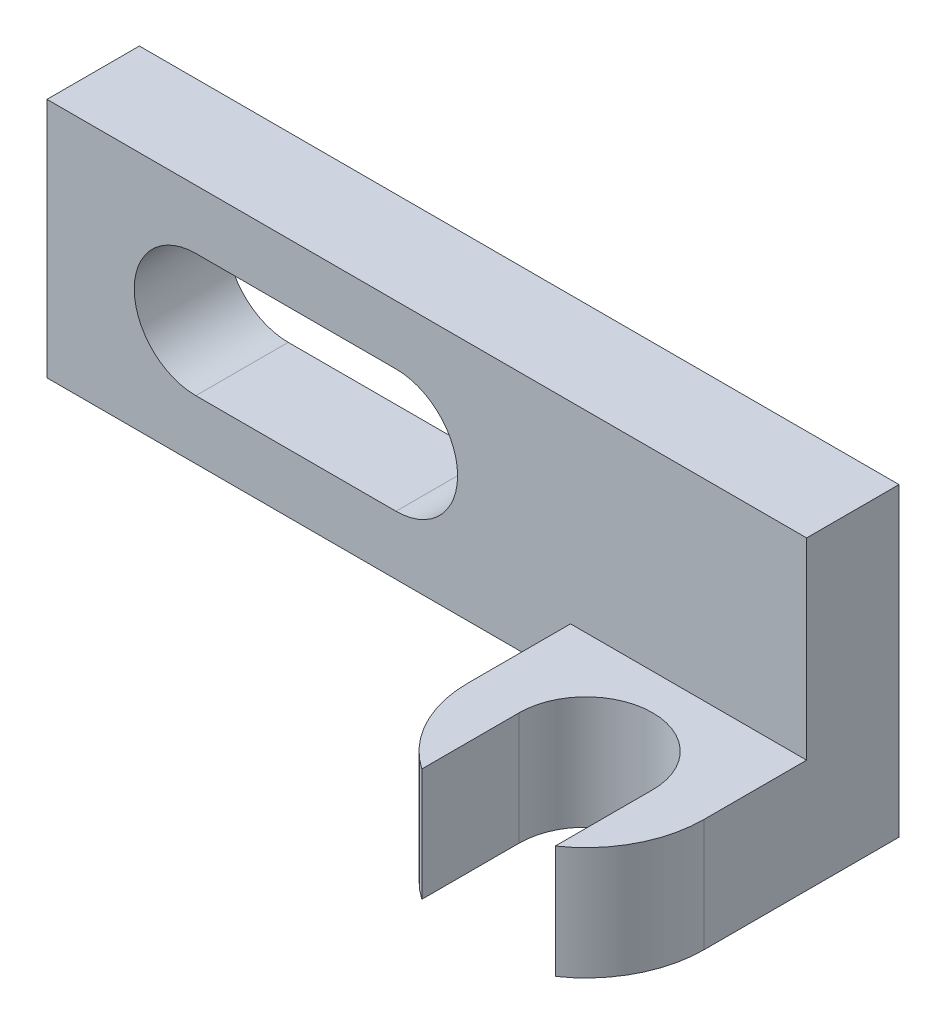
ISO-10303-21;
HEADER;
FILE_DESCRIPTION(('STEP AP214'),'2;1');
FILE_NAME('part.step','',(''),(''),'','','');
FILE_SCHEMA(('AUTOMOTIVE_DESIGN { 1 0 10303 214 1 1 1 1 }'));
ENDSEC;
DATA;
#1=APPLICATION_CONTEXT('core data for automotive mechanical design processes');
#2=APPLICATION_PROTOCOL_DEFINITION('international standard','automotive_design',2000,#1);
#3=PRODUCT_CONTEXT('',#1,'mechanical');
#4=PRODUCT('Part','Part','',(#3));
#5=PRODUCT_RELATED_PRODUCT_CATEGORY('part','',(#4));
#6=PRODUCT_DEFINITION_FORMATION('','',#4);
#7=PRODUCT_DEFINITION_CONTEXT('part definition',#1,'design');
#8=PRODUCT_DEFINITION('design','',#6,#7);
#9=PRODUCT_DEFINITION_SHAPE('','',#8);
#10=(LENGTH_UNIT() NAMED_UNIT(*) SI_UNIT(.MILLI.,.METRE.));
#11=(NAMED_UNIT(*) PLANE_ANGLE_UNIT() SI_UNIT($,.RADIAN.));
#12=(NAMED_UNIT(*) SI_UNIT($,.STERADIAN.) SOLID_ANGLE_UNIT());
#13=UNCERTAINTY_MEASURE_WITH_UNIT(LENGTH_MEASURE(1.E-05),#10,'distance_accuracy_value','');
#14=(GEOMETRIC_REPRESENTATION_CONTEXT(3) GLOBAL_UNCERTAINTY_ASSIGNED_CONTEXT((#13)) GLOBAL_UNIT_ASSIGNED_CONTEXT((#10,
#11,#12)) REPRESENTATION_CONTEXT('',''));
#15=CARTESIAN_POINT('',(0.,0.,0.));
#16=DIRECTION('',(0.,0.,1.));
#17=DIRECTION('',(1.,0.,0.));
#18=AXIS2_PLACEMENT_3D('',#15,#16,#17);
#19=CARTESIAN_POINT('',(-58.,-47.,36.));
#20=DIRECTION('',(0.,0.,1.));
#21=DIRECTION('',(1.,0.,0.));
#22=AXIS2_PLACEMENT_3D('',#19,#20,#21);
#23=PLANE('',#22);
#24=DIRECTION('',(0.,-1.,0.));
#25=VECTOR('',#24,1.);
#26=CARTESIAN_POINT('',(146.,-47.,36.));
#27=LINE('',#26,#25);
#28=CARTESIAN_POINT('',(146.,-28.,36.));
#29=VERTEX_POINT('',#28);
#30=CARTESIAN_POINT('',(146.,-47.,36.));
#31=VERTEX_POINT('',#30);
#32=EDGE_CURVE('E46',#29,#31,#27,.T.);
#33=ORIENTED_EDGE('',*,*,#32,.F.);
#34=DIRECTION('',(-1.,0.,0.));
#35=VECTOR('',#34,1.);
#36=CARTESIAN_POINT('',(-58.,-28.,36.));
#37=LINE('',#36,#35);
#38=CARTESIAN_POINT('',(238.,-28.,36.));
#39=VERTEX_POINT('',#38);
#40=EDGE_CURVE('E206',#39,#29,#37,.T.);
#41=ORIENTED_EDGE('',*,*,#40,.F.);
#42=DIRECTION('',(0.,1.,0.));
#43=VECTOR('',#42,1.);
#44=CARTESIAN_POINT('',(238.,47.,36.));
#45=LINE('',#44,#43);
#46=CARTESIAN_POINT('',(238.,47.,36.));
#47=VERTEX_POINT('',#46);
#48=EDGE_CURVE('E255',#39,#47,#45,.T.);
#49=ORIENTED_EDGE('',*,*,#48,.T.);
#50=DIRECTION('',(-1.,0.,0.));
#51=VECTOR('',#50,1.);
#52=CARTESIAN_POINT('',(-58.,47.,36.));
#53=LINE('',#52,#51);
#54=CARTESIAN_POINT('',(-58.,47.,36.));
#55=VERTEX_POINT('',#54);
#56=EDGE_CURVE('E257',#47,#55,#53,.T.);
#57=ORIENTED_EDGE('',*,*,#56,.T.);
#58=DIRECTION('',(0.,-1.,0.));
#59=VECTOR('',#58,1.);
#60=CARTESIAN_POINT('',(-58.,47.,36.));
#61=LINE('',#60,#59);
#62=CARTESIAN_POINT('',(-58.,-47.,36.));
#63=VERTEX_POINT('',#62);
#64=EDGE_CURVE('E248',#55,#63,#61,.T.);
#65=ORIENTED_EDGE('',*,*,#64,.T.);
#66=DIRECTION('',(1.,0.,0.));
#67=VECTOR('',#66,1.);
#68=CARTESIAN_POINT('',(-58.,-47.,36.));
#69=LINE('',#68,#67);
#70=EDGE_CURVE('E251',#63,#31,#69,.T.);
#71=ORIENTED_EDGE('',*,*,#70,.T.);
#72=EDGE_LOOP('',(#33,#41,#49,#57,#65,#71));
#73=FACE_BOUND('',#72,.T.);
#74=DIRECTION('',(1.,0.,0.));
#75=VECTOR('',#74,1.);
#76=CARTESIAN_POINT('',(78.,-24.,36.));
#77=LINE('',#76,#75);
#78=CARTESIAN_POINT('',(0.,-24.,36.));
#79=VERTEX_POINT('',#78);
#80=CARTESIAN_POINT('',(78.,-24.,36.));
#81=VERTEX_POINT('',#80);
#82=EDGE_CURVE('E221',#79,#81,#77,.T.);
#83=ORIENTED_EDGE('',*,*,#82,.F.);
#84=CARTESIAN_POINT('',(0.,0.,36.));
#85=DIRECTION('',(0.,0.,1.));
#86=DIRECTION('',(-1.,0.,0.));
#87=AXIS2_PLACEMENT_3D('',#84,#85,#86);
#88=CIRCLE('',#87,24.);
#89=CARTESIAN_POINT('',(0.,24.,36.));
#90=VERTEX_POINT('',#89);
#91=EDGE_CURVE('E219',#90,#79,#88,.T.);
#92=ORIENTED_EDGE('',*,*,#91,.F.);
#93=DIRECTION('',(-1.,0.,0.));
#94=VECTOR('',#93,1.);
#95=CARTESIAN_POINT('',(0.,24.,36.));
#96=LINE('',#95,#94);
#97=CARTESIAN_POINT('',(78.,24.,36.));
#98=VERTEX_POINT('',#97);
#99=EDGE_CURVE('E226',#98,#90,#96,.T.);
#100=ORIENTED_EDGE('',*,*,#99,.F.);
#101=CARTESIAN_POINT('',(78.,0.,36.));
#102=DIRECTION('',(0.,0.,1.));
#103=DIRECTION('',(-1.,0.,0.));
#104=AXIS2_PLACEMENT_3D('',#101,#102,#103);
#105=CIRCLE('',#104,24.);
#106=EDGE_CURVE('E224',#81,#98,#105,.T.);
#107=ORIENTED_EDGE('',*,*,#106,.F.);
#108=EDGE_LOOP('',(#83,#92,#100,#107));
#109=FACE_BOUND('',#108,.T.);
#110=ADVANCED_FACE('F31',(#73,#109),#23,.T.);
#111=CARTESIAN_POINT('',(-58.,-47.,0.));
#112=DIRECTION('',(0.,0.,1.));
#113=DIRECTION('',(1.,0.,0.));
#114=AXIS2_PLACEMENT_3D('',#111,#112,#113);
#115=PLANE('',#114);
#116=DIRECTION('',(0.,1.,0.));
#117=VECTOR('',#116,1.);
#118=CARTESIAN_POINT('',(146.,-72.,0.));
#119=LINE('',#118,#117);
#120=CARTESIAN_POINT('',(146.,-72.,0.));
#121=VERTEX_POINT('',#120);
#122=CARTESIAN_POINT('',(146.,-47.,0.));
#123=VERTEX_POINT('',#122);
#124=EDGE_CURVE('E143',#121,#123,#119,.T.);
#125=ORIENTED_EDGE('',*,*,#124,.T.);
#126=DIRECTION('',(1.,0.,0.));
#127=VECTOR('',#126,1.);
#128=CARTESIAN_POINT('',(-58.,-47.,0.));
#129=LINE('',#128,#127);
#130=CARTESIAN_POINT('',(-58.,-47.,0.));
#131=VERTEX_POINT('',#130);
#132=EDGE_CURVE('E262',#131,#123,#129,.T.);
#133=ORIENTED_EDGE('',*,*,#132,.F.);
#134=DIRECTION('',(0.,-1.,0.));
#135=VECTOR('',#134,1.);
#136=CARTESIAN_POINT('',(-58.,47.,0.));
#137=LINE('',#136,#135);
#138=CARTESIAN_POINT('',(-58.,47.,0.));
#139=VERTEX_POINT('',#138);
#140=EDGE_CURVE('E247',#139,#131,#137,.T.);
#141=ORIENTED_EDGE('',*,*,#140,.F.);
#142=DIRECTION('',(-1.,0.,0.));
#143=VECTOR('',#142,1.);
#144=CARTESIAN_POINT('',(-58.,47.,0.));
#145=LINE('',#144,#143);
#146=CARTESIAN_POINT('',(238.,47.,0.));
#147=VERTEX_POINT('',#146);
#148=EDGE_CURVE('E252',#147,#139,#145,.T.);
#149=ORIENTED_EDGE('',*,*,#148,.F.);
#150=DIRECTION('',(0.,1.,0.));
#151=VECTOR('',#150,1.);
#152=CARTESIAN_POINT('',(238.,47.,0.));
#153=LINE('',#152,#151);
#154=CARTESIAN_POINT('',(238.,-72.,0.));
#155=VERTEX_POINT('',#154);
#156=EDGE_CURVE('E168',#155,#147,#153,.T.);
#157=ORIENTED_EDGE('',*,*,#156,.F.);
#158=DIRECTION('',(-1.,0.,0.));
#159=VECTOR('',#158,1.);
#160=CARTESIAN_POINT('',(238.,-72.,0.));
#161=LINE('',#160,#159);
#162=EDGE_CURVE('E159',#155,#121,#161,.T.);
#163=ORIENTED_EDGE('',*,*,#162,.T.);
#164=EDGE_LOOP('',(#125,#133,#141,#149,#157,#163));
#165=FACE_BOUND('',#164,.T.);
#166=CARTESIAN_POINT('',(0.,0.,0.));
#167=DIRECTION('',(0.,0.,1.));
#168=DIRECTION('',(-1.,0.,0.));
#169=AXIS2_PLACEMENT_3D('',#166,#167,#168);
#170=CIRCLE('',#169,24.);
#171=CARTESIAN_POINT('',(0.,24.,0.));
#172=VERTEX_POINT('',#171);
#173=CARTESIAN_POINT('',(0.,-24.,0.));
#174=VERTEX_POINT('',#173);
#175=EDGE_CURVE('E218',#172,#174,#170,.T.);
#176=ORIENTED_EDGE('',*,*,#175,.T.);
#177=DIRECTION('',(1.,0.,0.));
#178=VECTOR('',#177,1.);
#179=CARTESIAN_POINT('',(78.,-24.,0.));
#180=LINE('',#179,#178);
#181=CARTESIAN_POINT('',(78.,-24.,0.));
#182=VERTEX_POINT('',#181);
#183=EDGE_CURVE('E231',#174,#182,#180,.T.);
#184=ORIENTED_EDGE('',*,*,#183,.T.);
#185=CARTESIAN_POINT('',(78.,0.,0.));
#186=DIRECTION('',(0.,0.,1.));
#187=DIRECTION('',(-1.,0.,0.));
#188=AXIS2_PLACEMENT_3D('',#185,#186,#187);
#189=CIRCLE('',#188,24.);
#190=CARTESIAN_POINT('',(78.,24.,0.));
#191=VERTEX_POINT('',#190);
#192=EDGE_CURVE('E234',#182,#191,#189,.T.);
#193=ORIENTED_EDGE('',*,*,#192,.T.);
#194=DIRECTION('',(-1.,0.,0.));
#195=VECTOR('',#194,1.);
#196=CARTESIAN_POINT('',(0.,24.,0.));
#197=LINE('',#196,#195);
#198=EDGE_CURVE('E222',#191,#172,#197,.T.);
#199=ORIENTED_EDGE('',*,*,#198,.T.);
#200=EDGE_LOOP('',(#176,#184,#193,#199));
#201=FACE_BOUND('',#200,.T.);
#202=ADVANCED_FACE('F165',(#165,#201),#115,.F.);
#203=CARTESIAN_POINT('',(-58.,47.,36.));
#204=DIRECTION('',(1.,0.,0.));
#205=DIRECTION('',(0.,1.,0.));
#206=AXIS2_PLACEMENT_3D('',#203,#204,#205);
#207=PLANE('',#206);
#208=ORIENTED_EDGE('',*,*,#140,.T.);
#209=DIRECTION('',(0.,0.,-1.));
#210=VECTOR('',#209,1.);
#211=CARTESIAN_POINT('',(-58.,-47.,36.));
#212=LINE('',#211,#210);
#213=EDGE_CURVE('E39',#63,#131,#212,.T.);
#214=ORIENTED_EDGE('',*,*,#213,.F.);
#215=ORIENTED_EDGE('',*,*,#64,.F.);
#216=DIRECTION('',(0.,0.,-1.));
#217=VECTOR('',#216,1.);
#218=CARTESIAN_POINT('',(-58.,47.,36.));
#219=LINE('',#218,#217);
#220=EDGE_CURVE('E259',#55,#139,#219,.T.);
#221=ORIENTED_EDGE('',*,*,#220,.T.);
#222=EDGE_LOOP('',(#208,#214,#215,#221));
#223=FACE_BOUND('',#222,.T.);
#224=ADVANCED_FACE('F33',(#223),#207,.F.);
#225=CARTESIAN_POINT('',(-58.,-47.,36.));
#226=DIRECTION('',(0.,1.,0.));
#227=DIRECTION('',(-1.,0.,0.));
#228=AXIS2_PLACEMENT_3D('',#225,#226,#227);
#229=PLANE('',#228);
#230=ORIENTED_EDGE('',*,*,#132,.T.);
#231=DIRECTION('',(0.,0.,1.));
#232=VECTOR('',#231,1.);
#233=CARTESIAN_POINT('',(146.,-47.,35.9999999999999));
#234=LINE('',#233,#232);
#235=EDGE_CURVE('E11',#123,#31,#234,.T.);
#236=ORIENTED_EDGE('',*,*,#235,.T.);
#237=ORIENTED_EDGE('',*,*,#70,.F.);
#238=ORIENTED_EDGE('',*,*,#213,.T.);
#239=EDGE_LOOP('',(#230,#236,#237,#238));
#240=FACE_BOUND('',#239,.T.);
#241=ADVANCED_FACE('F273',(#240),#229,.F.);
#242=CARTESIAN_POINT('',(238.,47.,36.));
#243=DIRECTION('',(-1.,0.,0.));
#244=DIRECTION('',(0.,0.,1.));
#245=AXIS2_PLACEMENT_3D('',#242,#243,#244);
#246=PLANE('',#245);
#247=ORIENTED_EDGE('',*,*,#48,.F.);
#248=DIRECTION('',(0.,0.,-1.));
#249=VECTOR('',#248,1.);
#250=CARTESIAN_POINT('',(238.,-28.,76.));
#251=LINE('',#250,#249);
#252=CARTESIAN_POINT('',(238.,-28.,76.));
#253=VERTEX_POINT('',#252);
#254=EDGE_CURVE('E169',#253,#39,#251,.T.);
#255=ORIENTED_EDGE('',*,*,#254,.F.);
#256=DIRECTION('',(0.,1.,0.));
#257=VECTOR('',#256,1.);
#258=CARTESIAN_POINT('',(238.,-72.,76.));
#259=LINE('',#258,#257);
#260=CARTESIAN_POINT('',(238.,-72.,76.));
#261=VERTEX_POINT('',#260);
#262=EDGE_CURVE('E204',#261,#253,#259,.T.);
#263=ORIENTED_EDGE('',*,*,#262,.F.);
#264=DIRECTION('',(0.,0.,-1.));
#265=VECTOR('',#264,1.);
#266=CARTESIAN_POINT('',(238.,-72.,76.));
#267=LINE('',#266,#265);
#268=EDGE_CURVE('E152',#261,#155,#267,.T.);
#269=ORIENTED_EDGE('',*,*,#268,.T.);
#270=ORIENTED_EDGE('',*,*,#156,.T.);
#271=DIRECTION('',(0.,0.,-1.));
#272=VECTOR('',#271,1.);
#273=CARTESIAN_POINT('',(238.,47.,36.));
#274=LINE('',#273,#272);
#275=EDGE_CURVE('E268',#47,#147,#274,.T.);
#276=ORIENTED_EDGE('',*,*,#275,.F.);
#277=EDGE_LOOP('',(#247,#255,#263,#269,#270,#276));
#278=FACE_BOUND('',#277,.T.);
#279=ADVANCED_FACE('F284',(#278),#246,.F.);
#280=CARTESIAN_POINT('',(-58.,47.,36.));
#281=DIRECTION('',(0.,-1.,0.));
#282=DIRECTION('',(0.,0.,-1.));
#283=AXIS2_PLACEMENT_3D('',#280,#281,#282);
#284=PLANE('',#283);
#285=ORIENTED_EDGE('',*,*,#148,.T.);
#286=ORIENTED_EDGE('',*,*,#220,.F.);
#287=ORIENTED_EDGE('',*,*,#56,.F.);
#288=ORIENTED_EDGE('',*,*,#275,.T.);
#289=EDGE_LOOP('',(#285,#286,#287,#288));
#290=FACE_BOUND('',#289,.T.);
#291=ADVANCED_FACE('F279',(#290),#284,.F.);
#292=CARTESIAN_POINT('',(0.,0.,36.));
#293=DIRECTION('',(0.,0.,-1.));
#294=DIRECTION('',(-1.,0.,0.));
#295=AXIS2_PLACEMENT_3D('',#292,#293,#294);
#296=CYLINDRICAL_SURFACE('',#295,24.);
#297=ORIENTED_EDGE('',*,*,#175,.F.);
#298=DIRECTION('',(0.,0.,-1.));
#299=VECTOR('',#298,1.);
#300=CARTESIAN_POINT('',(0.,24.,36.));
#301=LINE('',#300,#299);
#302=EDGE_CURVE('E228',#90,#172,#301,.T.);
#303=ORIENTED_EDGE('',*,*,#302,.F.);
#304=ORIENTED_EDGE('',*,*,#91,.T.);
#305=DIRECTION('',(0.,0.,-1.));
#306=VECTOR('',#305,1.);
#307=CARTESIAN_POINT('',(0.,-24.,36.));
#308=LINE('',#307,#306);
#309=EDGE_CURVE('E244',#79,#174,#308,.T.);
#310=ORIENTED_EDGE('',*,*,#309,.T.);
#311=EDGE_LOOP('',(#297,#303,#304,#310));
#312=FACE_BOUND('',#311,.T.);
#313=ADVANCED_FACE('F327',(#312),#296,.F.);
#314=CARTESIAN_POINT('',(78.,-24.,36.));
#315=DIRECTION('',(0.,1.,0.));
#316=DIRECTION('',(-1.,0.,0.));
#317=AXIS2_PLACEMENT_3D('',#314,#315,#316);
#318=PLANE('',#317);
#319=ORIENTED_EDGE('',*,*,#183,.F.);
#320=ORIENTED_EDGE('',*,*,#309,.F.);
#321=ORIENTED_EDGE('',*,*,#82,.T.);
#322=DIRECTION('',(0.,0.,-1.));
#323=VECTOR('',#322,1.);
#324=CARTESIAN_POINT('',(78.,-24.,36.));
#325=LINE('',#324,#323);
#326=EDGE_CURVE('E242',#81,#182,#325,.T.);
#327=ORIENTED_EDGE('',*,*,#326,.T.);
#328=EDGE_LOOP('',(#319,#320,#321,#327));
#329=FACE_BOUND('',#328,.T.);
#330=ADVANCED_FACE('F423',(#329),#318,.T.);
#331=CARTESIAN_POINT('',(78.,0.,36.));
#332=DIRECTION('',(0.,0.,-1.));
#333=DIRECTION('',(-1.,0.,0.));
#334=AXIS2_PLACEMENT_3D('',#331,#332,#333);
#335=CYLINDRICAL_SURFACE('',#334,24.);
#336=ORIENTED_EDGE('',*,*,#192,.F.);
#337=ORIENTED_EDGE('',*,*,#326,.F.);
#338=ORIENTED_EDGE('',*,*,#106,.T.);
#339=DIRECTION('',(0.,0.,-1.));
#340=VECTOR('',#339,1.);
#341=CARTESIAN_POINT('',(78.,24.,36.));
#342=LINE('',#341,#340);
#343=EDGE_CURVE('E53',#98,#191,#342,.T.);
#344=ORIENTED_EDGE('',*,*,#343,.T.);
#345=EDGE_LOOP('',(#336,#337,#338,#344));
#346=FACE_BOUND('',#345,.T.);
#347=ADVANCED_FACE('F317',(#346),#335,.F.);
#348=CARTESIAN_POINT('',(0.,24.,36.));
#349=DIRECTION('',(0.,-1.,0.));
#350=DIRECTION('',(1.,0.,0.));
#351=AXIS2_PLACEMENT_3D('',#348,#349,#350);
#352=PLANE('',#351);
#353=ORIENTED_EDGE('',*,*,#198,.F.);
#354=ORIENTED_EDGE('',*,*,#343,.F.);
#355=ORIENTED_EDGE('',*,*,#99,.T.);
#356=ORIENTED_EDGE('',*,*,#302,.T.);
#357=EDGE_LOOP('',(#353,#354,#355,#356));
#358=FACE_BOUND('',#357,.T.);
#359=ADVANCED_FACE('F310',(#358),#352,.T.);
#360=CARTESIAN_POINT('',(192.,-72.,76.));
#361=DIRECTION('',(0.,1.,0.));
#362=DIRECTION('',(0.,0.,1.));
#363=AXIS2_PLACEMENT_3D('',#360,#361,#362);
#364=CYLINDRICAL_SURFACE('',#363,46.);
#365=CARTESIAN_POINT('',(192.,-28.,76.));
#366=DIRECTION('',(0.,1.,0.));
#367=DIRECTION('',(0.,0.,1.));
#368=AXIS2_PLACEMENT_3D('',#365,#366,#367);
#369=CIRCLE('',#368,46.);
#370=CARTESIAN_POINT('',(218.,-28.,113.947331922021));
#371=VERTEX_POINT('',#370);
#372=EDGE_CURVE('E171',#371,#253,#369,.T.);
#373=ORIENTED_EDGE('',*,*,#372,.F.);
#374=DIRECTION('',(0.,1.,0.));
#375=VECTOR('',#374,1.);
#376=CARTESIAN_POINT('',(218.,-72.,113.947331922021));
#377=LINE('',#376,#375);
#378=CARTESIAN_POINT('',(218.,-72.,113.947331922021));
#379=VERTEX_POINT('',#378);
#380=EDGE_CURVE('E207',#379,#371,#377,.T.);
#381=ORIENTED_EDGE('',*,*,#380,.F.);
#382=CARTESIAN_POINT('',(192.,-72.,76.));
#383=DIRECTION('',(0.,1.,0.));
#384=DIRECTION('',(0.,0.,1.));
#385=AXIS2_PLACEMENT_3D('',#382,#383,#384);
#386=CIRCLE('',#385,46.);
#387=EDGE_CURVE('E184',#379,#261,#386,.T.);
#388=ORIENTED_EDGE('',*,*,#387,.T.);
#389=ORIENTED_EDGE('',*,*,#262,.T.);
#390=EDGE_LOOP('',(#373,#381,#388,#389));
#391=FACE_BOUND('',#390,.T.);
#392=ADVANCED_FACE('F308',(#391),#364,.T.);
#393=CARTESIAN_POINT('',(218.,-72.,76.));
#394=DIRECTION('',(-1.,0.,0.));
#395=DIRECTION('',(0.,0.,1.));
#396=AXIS2_PLACEMENT_3D('',#393,#394,#395);
#397=PLANE('',#396);
#398=DIRECTION('',(0.,0.,1.));
#399=VECTOR('',#398,1.);
#400=CARTESIAN_POINT('',(218.,-28.,76.));
#401=LINE('',#400,#399);
#402=CARTESIAN_POINT('',(218.,-28.,76.));
#403=VERTEX_POINT('',#402);
#404=EDGE_CURVE('E199',#403,#371,#401,.T.);
#405=ORIENTED_EDGE('',*,*,#404,.F.);
#406=DIRECTION('',(0.,1.,0.));
#407=VECTOR('',#406,1.);
#408=CARTESIAN_POINT('',(218.,-72.,76.));
#409=LINE('',#408,#407);
#410=CARTESIAN_POINT('',(218.,-72.,76.));
#411=VERTEX_POINT('',#410);
#412=EDGE_CURVE('E209',#411,#403,#409,.T.);
#413=ORIENTED_EDGE('',*,*,#412,.F.);
#414=DIRECTION('',(0.,0.,1.));
#415=VECTOR('',#414,1.);
#416=CARTESIAN_POINT('',(218.,-72.,76.));
#417=LINE('',#416,#415);
#418=EDGE_CURVE('E181',#411,#379,#417,.T.);
#419=ORIENTED_EDGE('',*,*,#418,.T.);
#420=ORIENTED_EDGE('',*,*,#380,.T.);
#421=EDGE_LOOP('',(#405,#413,#419,#420));
#422=FACE_BOUND('',#421,.T.);
#423=ADVANCED_FACE('F292',(#422),#397,.T.);
#424=CARTESIAN_POINT('',(192.,-72.,76.));
#425=DIRECTION('',(0.,1.,0.));
#426=DIRECTION('',(0.,0.,1.));
#427=AXIS2_PLACEMENT_3D('',#424,#425,#426);
#428=CYLINDRICAL_SURFACE('',#427,26.);
#429=CARTESIAN_POINT('',(192.,-28.,76.));
#430=DIRECTION('',(0.,-1.,0.));
#431=DIRECTION('',(0.,0.,-1.));
#432=AXIS2_PLACEMENT_3D('',#429,#430,#431);
#433=CIRCLE('',#432,26.);
#434=CARTESIAN_POINT('',(166.,-28.,76.));
#435=VERTEX_POINT('',#434);
#436=EDGE_CURVE('E196',#435,#403,#433,.T.);
#437=ORIENTED_EDGE('',*,*,#436,.F.);
#438=DIRECTION('',(0.,1.,0.));
#439=VECTOR('',#438,1.);
#440=CARTESIAN_POINT('',(166.,-72.,76.));
#441=LINE('',#440,#439);
#442=CARTESIAN_POINT('',(166.,-72.,76.));
#443=VERTEX_POINT('',#442);
#444=EDGE_CURVE('E211',#443,#435,#441,.T.);
#445=ORIENTED_EDGE('',*,*,#444,.F.);
#446=CARTESIAN_POINT('',(192.,-72.,76.));
#447=DIRECTION('',(0.,-1.,0.));
#448=DIRECTION('',(0.,0.,-1.));
#449=AXIS2_PLACEMENT_3D('',#446,#447,#448);
#450=CIRCLE('',#449,26.);
#451=EDGE_CURVE('E178',#443,#411,#450,.T.);
#452=ORIENTED_EDGE('',*,*,#451,.T.);
#453=ORIENTED_EDGE('',*,*,#412,.T.);
#454=EDGE_LOOP('',(#437,#445,#452,#453));
#455=FACE_BOUND('',#454,.T.);
#456=ADVANCED_FACE('F296',(#455),#428,.F.);
#457=CARTESIAN_POINT('',(166.,-72.,113.947331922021));
#458=DIRECTION('',(1.,0.,0.));
#459=DIRECTION('',(0.,0.,-1.));
#460=AXIS2_PLACEMENT_3D('',#457,#458,#459);
#461=PLANE('',#460);
#462=DIRECTION('',(0.,0.,-1.));
#463=VECTOR('',#462,1.);
#464=CARTESIAN_POINT('',(166.,-28.,113.947331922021));
#465=LINE('',#464,#463);
#466=CARTESIAN_POINT('',(166.,-28.,113.947331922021));
#467=VERTEX_POINT('',#466);
#468=EDGE_CURVE('E193',#467,#435,#465,.T.);
#469=ORIENTED_EDGE('',*,*,#468,.F.);
#470=DIRECTION('',(0.,1.,0.));
#471=VECTOR('',#470,1.);
#472=CARTESIAN_POINT('',(166.,-72.,113.947331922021));
#473=LINE('',#472,#471);
#474=CARTESIAN_POINT('',(166.,-72.,113.947331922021));
#475=VERTEX_POINT('',#474);
#476=EDGE_CURVE('E213',#475,#467,#473,.T.);
#477=ORIENTED_EDGE('',*,*,#476,.F.);
#478=DIRECTION('',(0.,0.,-1.));
#479=VECTOR('',#478,1.);
#480=CARTESIAN_POINT('',(166.,-72.,113.947331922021));
#481=LINE('',#480,#479);
#482=EDGE_CURVE('E175',#475,#443,#481,.T.);
#483=ORIENTED_EDGE('',*,*,#482,.T.);
#484=ORIENTED_EDGE('',*,*,#444,.T.);
#485=EDGE_LOOP('',(#469,#477,#483,#484));
#486=FACE_BOUND('',#485,.T.);
#487=ADVANCED_FACE('F299',(#486),#461,.T.);
#488=CARTESIAN_POINT('',(192.,-72.,76.));
#489=DIRECTION('',(0.,1.,0.));
#490=DIRECTION('',(0.,0.,1.));
#491=AXIS2_PLACEMENT_3D('',#488,#489,#490);
#492=CYLINDRICAL_SURFACE('',#491,46.);
#493=CARTESIAN_POINT('',(192.,-28.,76.));
#494=DIRECTION('',(0.,1.,0.));
#495=DIRECTION('',(0.,0.,1.));
#496=AXIS2_PLACEMENT_3D('',#493,#494,#495);
#497=CIRCLE('',#496,46.);
#498=CARTESIAN_POINT('',(146.,-28.,76.));
#499=VERTEX_POINT('',#498);
#500=EDGE_CURVE('E190',#499,#467,#497,.T.);
#501=ORIENTED_EDGE('',*,*,#500,.F.);
#502=DIRECTION('',(0.,1.,0.));
#503=VECTOR('',#502,1.);
#504=CARTESIAN_POINT('',(146.,-72.,76.));
#505=LINE('',#504,#503);
#506=CARTESIAN_POINT('',(146.,-72.,76.));
#507=VERTEX_POINT('',#506);
#508=EDGE_CURVE('E151',#507,#499,#505,.T.);
#509=ORIENTED_EDGE('',*,*,#508,.F.);
#510=CARTESIAN_POINT('',(192.,-72.,76.));
#511=DIRECTION('',(0.,1.,0.));
#512=DIRECTION('',(0.,0.,1.));
#513=AXIS2_PLACEMENT_3D('',#510,#511,#512);
#514=CIRCLE('',#513,46.);
#515=EDGE_CURVE('E163',#507,#475,#514,.T.);
#516=ORIENTED_EDGE('',*,*,#515,.T.);
#517=ORIENTED_EDGE('',*,*,#476,.T.);
#518=EDGE_LOOP('',(#501,#509,#516,#517));
#519=FACE_BOUND('',#518,.T.);
#520=ADVANCED_FACE('F302',(#519),#492,.T.);
#521=CARTESIAN_POINT('',(146.,-72.,0.));
#522=DIRECTION('',(-1.,0.,0.));
#523=DIRECTION('',(0.,0.,1.));
#524=AXIS2_PLACEMENT_3D('',#521,#522,#523);
#525=PLANE('',#524);
#526=DIRECTION('',(0.,0.,1.));
#527=VECTOR('',#526,1.);
#528=CARTESIAN_POINT('',(146.,-28.,0.));
#529=LINE('',#528,#527);
#530=EDGE_CURVE('E188',#29,#499,#529,.T.);
#531=ORIENTED_EDGE('',*,*,#530,.F.);
#532=ORIENTED_EDGE('',*,*,#32,.T.);
#533=ORIENTED_EDGE('',*,*,#235,.F.);
#534=ORIENTED_EDGE('',*,*,#124,.F.);
#535=DIRECTION('',(0.,0.,1.));
#536=VECTOR('',#535,1.);
#537=CARTESIAN_POINT('',(146.,-72.,0.));
#538=LINE('',#537,#536);
#539=EDGE_CURVE('E147',#121,#507,#538,.T.);
#540=ORIENTED_EDGE('',*,*,#539,.T.);
#541=ORIENTED_EDGE('',*,*,#508,.T.);
#542=EDGE_LOOP('',(#531,#532,#533,#534,#540,#541));
#543=FACE_BOUND('',#542,.T.);
#544=ADVANCED_FACE('F145',(#543),#525,.T.);
#545=CARTESIAN_POINT('',(192.,-72.,76.));
#546=DIRECTION('',(0.,1.,0.));
#547=DIRECTION('',(0.,0.,1.));
#548=AXIS2_PLACEMENT_3D('',#545,#546,#547);
#549=PLANE('',#548);
#550=ORIENTED_EDGE('',*,*,#162,.F.);
#551=ORIENTED_EDGE('',*,*,#268,.F.);
#552=ORIENTED_EDGE('',*,*,#387,.F.);
#553=ORIENTED_EDGE('',*,*,#418,.F.);
#554=ORIENTED_EDGE('',*,*,#451,.F.);
#555=ORIENTED_EDGE('',*,*,#482,.F.);
#556=ORIENTED_EDGE('',*,*,#515,.F.);
#557=ORIENTED_EDGE('',*,*,#539,.F.);
#558=EDGE_LOOP('',(#550,#551,#552,#553,#554,#555,#556,#557));
#559=FACE_BOUND('',#558,.T.);
#560=ADVANCED_FACE('F157',(#559),#549,.F.);
#561=CARTESIAN_POINT('',(192.,-28.,76.));
#562=DIRECTION('',(0.,1.,0.));
#563=DIRECTION('',(0.,0.,1.));
#564=AXIS2_PLACEMENT_3D('',#561,#562,#563);
#565=PLANE('',#564);
#566=ORIENTED_EDGE('',*,*,#254,.T.);
#567=ORIENTED_EDGE('',*,*,#40,.T.);
#568=ORIENTED_EDGE('',*,*,#530,.T.);
#569=ORIENTED_EDGE('',*,*,#500,.T.);
#570=ORIENTED_EDGE('',*,*,#468,.T.);
#571=ORIENTED_EDGE('',*,*,#436,.T.);
#572=ORIENTED_EDGE('',*,*,#404,.T.);
#573=ORIENTED_EDGE('',*,*,#372,.T.);
#574=EDGE_LOOP('',(#566,#567,#568,#569,#570,#571,#572,#573));
#575=FACE_BOUND('',#574,.T.);
#576=ADVANCED_FACE('F307',(#575),#565,.T.);
#577=CLOSED_SHELL('',(#110,#202,#224,#241,#279,#291,#313,#330,#347,#359,#392,#423,#456,#487,
#520,#544,#560,#576));
#578=MANIFOLD_SOLID_BREP('B2',#577);
#579=ADVANCED_BREP_SHAPE_REPRESENTATION('',(#18,#578),#14);
#580=SHAPE_DEFINITION_REPRESENTATION(#9,#579);
ENDSEC;
END-ISO-10303-21;
